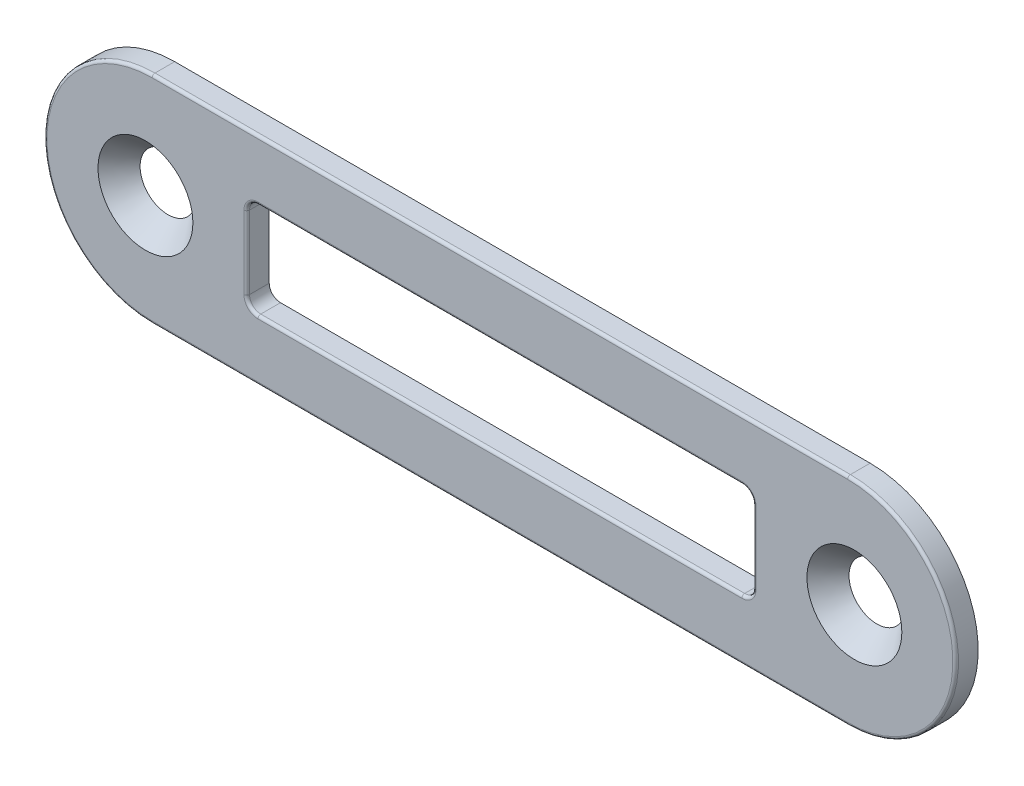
ISO-10303-21;
HEADER;
FILE_DESCRIPTION(('STEP AP214'),'2;1');
FILE_NAME('part.step','',(''),(''),'','','');
FILE_SCHEMA(('AUTOMOTIVE_DESIGN { 1 0 10303 214 1 1 1 1 }'));
ENDSEC;
DATA;
#1=APPLICATION_CONTEXT('core data for automotive mechanical design processes');
#2=APPLICATION_PROTOCOL_DEFINITION('international standard','automotive_design',2000,#1);
#3=PRODUCT_CONTEXT('',#1,'mechanical');
#4=PRODUCT('Part','Part','',(#3));
#5=PRODUCT_RELATED_PRODUCT_CATEGORY('part','',(#4));
#6=PRODUCT_DEFINITION_FORMATION('','',#4);
#7=PRODUCT_DEFINITION_CONTEXT('part definition',#1,'design');
#8=PRODUCT_DEFINITION('design','',#6,#7);
#9=PRODUCT_DEFINITION_SHAPE('','',#8);
#10=(LENGTH_UNIT() NAMED_UNIT(*) SI_UNIT(.MILLI.,.METRE.));
#11=(NAMED_UNIT(*) PLANE_ANGLE_UNIT() SI_UNIT($,.RADIAN.));
#12=(NAMED_UNIT(*) SI_UNIT($,.STERADIAN.) SOLID_ANGLE_UNIT());
#13=UNCERTAINTY_MEASURE_WITH_UNIT(LENGTH_MEASURE(1.E-05),#10,'distance_accuracy_value','');
#14=(GEOMETRIC_REPRESENTATION_CONTEXT(3) GLOBAL_UNCERTAINTY_ASSIGNED_CONTEXT((#13)) GLOBAL_UNIT_ASSIGNED_CONTEXT((#10,
#11,#12)) REPRESENTATION_CONTEXT('',''));
#15=CARTESIAN_POINT('',(0.,0.,0.));
#16=DIRECTION('',(0.,0.,1.));
#17=DIRECTION('',(1.,0.,0.));
#18=AXIS2_PLACEMENT_3D('',#15,#16,#17);
#19=CARTESIAN_POINT('',(0.,9.6,0.));
#20=DIRECTION('',(0.,0.,1.));
#21=DIRECTION('',(1.,0.,0.));
#22=AXIS2_PLACEMENT_3D('',#19,#20,#21);
#23=PLANE('',#22);
#24=CARTESIAN_POINT('',(-0.599999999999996,9.60000000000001,0.));
#25=DIRECTION('',(0.,0.,1.));
#26=DIRECTION('',(1.,0.,0.));
#27=AXIS2_PLACEMENT_3D('',#24,#25,#26);
#28=CIRCLE('',#27,2.47782652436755);
#29=CARTESIAN_POINT('',(1.87782652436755,9.60000000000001,0.));
#30=VERTEX_POINT('',#29);
#31=EDGE_CURVE('E232',#30,#30,#28,.T.);
#32=ORIENTED_EDGE('',*,*,#31,.T.);
#33=EDGE_LOOP('',(#32));
#34=FACE_BOUND('',#33,.T.);
#35=CARTESIAN_POINT('',(0.,9.6,0.));
#36=DIRECTION('',(0.,0.,1.));
#37=DIRECTION('',(1.,0.,0.));
#38=AXIS2_PLACEMENT_3D('',#35,#36,#37);
#39=CIRCLE('',#38,9.6);
#40=CARTESIAN_POINT('',(0.,19.2,0.));
#41=VERTEX_POINT('',#40);
#42=CARTESIAN_POINT('',(0.,0.,0.));
#43=VERTEX_POINT('',#42);
#44=EDGE_CURVE('E194',#41,#43,#39,.T.);
#45=ORIENTED_EDGE('',*,*,#44,.F.);
#46=DIRECTION('',(-1.,0.,0.));
#47=VECTOR('',#46,1.);
#48=CARTESIAN_POINT('',(0.,19.2,0.));
#49=LINE('',#48,#47);
#50=CARTESIAN_POINT('',(61.8,19.2,0.));
#51=VERTEX_POINT('',#50);
#52=EDGE_CURVE('E216',#51,#41,#49,.T.);
#53=ORIENTED_EDGE('',*,*,#52,.F.);
#54=CARTESIAN_POINT('',(61.8,9.60000000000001,0.));
#55=DIRECTION('',(0.,0.,1.));
#56=DIRECTION('',(-1.,0.,0.));
#57=AXIS2_PLACEMENT_3D('',#54,#55,#56);
#58=CIRCLE('',#57,9.6);
#59=CARTESIAN_POINT('',(61.8,0.,0.));
#60=VERTEX_POINT('',#59);
#61=EDGE_CURVE('E196',#60,#51,#58,.T.);
#62=ORIENTED_EDGE('',*,*,#61,.F.);
#63=DIRECTION('',(1.,0.,0.));
#64=VECTOR('',#63,1.);
#65=CARTESIAN_POINT('',(0.,0.,0.));
#66=LINE('',#65,#64);
#67=EDGE_CURVE('E179',#43,#60,#66,.T.);
#68=ORIENTED_EDGE('',*,*,#67,.F.);
#69=EDGE_LOOP('',(#45,#53,#62,#68));
#70=FACE_BOUND('',#69,.T.);
#71=DIRECTION('',(0.,-1.,0.));
#72=VECTOR('',#71,1.);
#73=CARTESIAN_POINT('',(8.4,13.85,0.));
#74=LINE('',#73,#72);
#75=CARTESIAN_POINT('',(8.4,12.85,0.));
#76=VERTEX_POINT('',#75);
#77=CARTESIAN_POINT('',(8.4,6.35000000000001,0.));
#78=VERTEX_POINT('',#77);
#79=EDGE_CURVE('E210',#76,#78,#74,.T.);
#80=ORIENTED_EDGE('',*,*,#79,.T.);
#81=CARTESIAN_POINT('',(9.4,6.35000000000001,0.));
#82=DIRECTION('',(0.,0.,1.));
#83=DIRECTION('',(1.,0.,0.));
#84=AXIS2_PLACEMENT_3D('',#81,#82,#83);
#85=CIRCLE('',#84,1.);
#86=CARTESIAN_POINT('',(9.4,5.35000000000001,0.));
#87=VERTEX_POINT('',#86);
#88=EDGE_CURVE('E269',#78,#87,#85,.T.);
#89=ORIENTED_EDGE('',*,*,#88,.T.);
#90=DIRECTION('',(1.,0.,0.));
#91=VECTOR('',#90,1.);
#92=CARTESIAN_POINT('',(8.4,5.35000000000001,0.));
#93=LINE('',#92,#91);
#94=CARTESIAN_POINT('',(52.4,5.35000000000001,0.));
#95=VERTEX_POINT('',#94);
#96=EDGE_CURVE('E203',#87,#95,#93,.T.);
#97=ORIENTED_EDGE('',*,*,#96,.T.);
#98=CARTESIAN_POINT('',(52.4,6.35000000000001,0.));
#99=DIRECTION('',(0.,0.,1.));
#100=DIRECTION('',(1.,0.,0.));
#101=AXIS2_PLACEMENT_3D('',#98,#99,#100);
#102=CIRCLE('',#101,1.);
#103=CARTESIAN_POINT('',(53.4,6.35000000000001,0.));
#104=VERTEX_POINT('',#103);
#105=EDGE_CURVE('E267',#95,#104,#102,.T.);
#106=ORIENTED_EDGE('',*,*,#105,.T.);
#107=DIRECTION('',(0.,1.,0.));
#108=VECTOR('',#107,1.);
#109=CARTESIAN_POINT('',(53.4,13.85,0.));
#110=LINE('',#109,#108);
#111=CARTESIAN_POINT('',(53.4,12.85,0.));
#112=VERTEX_POINT('',#111);
#113=EDGE_CURVE('E230',#104,#112,#110,.T.);
#114=ORIENTED_EDGE('',*,*,#113,.T.);
#115=CARTESIAN_POINT('',(52.4,12.85,0.));
#116=DIRECTION('',(0.,0.,1.));
#117=DIRECTION('',(1.,0.,0.));
#118=AXIS2_PLACEMENT_3D('',#115,#116,#117);
#119=CIRCLE('',#118,1.);
#120=CARTESIAN_POINT('',(52.4,13.85,0.));
#121=VERTEX_POINT('',#120);
#122=EDGE_CURVE('E264',#112,#121,#119,.T.);
#123=ORIENTED_EDGE('',*,*,#122,.T.);
#124=DIRECTION('',(-1.,0.,0.));
#125=VECTOR('',#124,1.);
#126=CARTESIAN_POINT('',(8.4,13.85,0.));
#127=LINE('',#126,#125);
#128=CARTESIAN_POINT('',(9.4,13.85,0.));
#129=VERTEX_POINT('',#128);
#130=EDGE_CURVE('E467',#121,#129,#127,.T.);
#131=ORIENTED_EDGE('',*,*,#130,.T.);
#132=CARTESIAN_POINT('',(9.4,12.85,0.));
#133=DIRECTION('',(0.,0.,1.));
#134=DIRECTION('',(1.,0.,0.));
#135=AXIS2_PLACEMENT_3D('',#132,#133,#134);
#136=CIRCLE('',#135,1.);
#137=EDGE_CURVE('E272',#129,#76,#136,.T.);
#138=ORIENTED_EDGE('',*,*,#137,.T.);
#139=EDGE_LOOP('',(#80,#89,#97,#106,#114,#123,#131,#138));
#140=FACE_BOUND('',#139,.T.);
#141=CARTESIAN_POINT('',(62.4,9.6,0.));
#142=DIRECTION('',(0.,0.,1.));
#143=DIRECTION('',(1.,0.,0.));
#144=AXIS2_PLACEMENT_3D('',#141,#142,#143);
#145=CIRCLE('',#144,2.47782652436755);
#146=CARTESIAN_POINT('',(64.8778265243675,9.6,0.));
#147=VERTEX_POINT('',#146);
#148=EDGE_CURVE('E226',#147,#147,#145,.T.);
#149=ORIENTED_EDGE('',*,*,#148,.T.);
#150=EDGE_LOOP('',(#149));
#151=FACE_BOUND('',#150,.T.);
#152=ADVANCED_FACE('F48',(#34,#70,#140,#151),#23,.F.);
#153=CARTESIAN_POINT('',(0.,9.6,2.));
#154=DIRECTION('',(0.,0.,-1.));
#155=DIRECTION('',(-1.,0.,0.));
#156=AXIS2_PLACEMENT_3D('',#153,#154,#155);
#157=CYLINDRICAL_SURFACE('',#156,9.6);
#158=DIRECTION('',(0.,0.,-1.));
#159=VECTOR('',#158,1.);
#160=CARTESIAN_POINT('',(0.,0.,2.));
#161=LINE('',#160,#159);
#162=CARTESIAN_POINT('',(0.,0.,1.75));
#163=VERTEX_POINT('',#162);
#164=EDGE_CURVE('E176',#163,#43,#161,.T.);
#165=ORIENTED_EDGE('',*,*,#164,.F.);
#166=CARTESIAN_POINT('',(0.,9.6,1.75));
#167=DIRECTION('',(0.,0.,1.));
#168=DIRECTION('',(1.,0.,0.));
#169=AXIS2_PLACEMENT_3D('',#166,#167,#168);
#170=CIRCLE('',#169,9.6);
#171=CARTESIAN_POINT('',(0.,19.2,1.75));
#172=VERTEX_POINT('',#171);
#173=EDGE_CURVE('E335',#163,#172,#170,.F.);
#174=ORIENTED_EDGE('',*,*,#173,.T.);
#175=DIRECTION('',(0.,0.,-1.));
#176=VECTOR('',#175,1.);
#177=CARTESIAN_POINT('',(0.,19.2,2.));
#178=LINE('',#177,#176);
#179=EDGE_CURVE('E200',#172,#41,#178,.T.);
#180=ORIENTED_EDGE('',*,*,#179,.T.);
#181=ORIENTED_EDGE('',*,*,#44,.T.);
#182=EDGE_LOOP('',(#165,#174,#180,#181));
#183=FACE_BOUND('',#182,.T.);
#184=ADVANCED_FACE('F199',(#183),#157,.T.);
#185=CARTESIAN_POINT('',(0.,0.,2.));
#186=DIRECTION('',(0.,1.,0.));
#187=DIRECTION('',(-1.,0.,0.));
#188=AXIS2_PLACEMENT_3D('',#185,#186,#187);
#189=PLANE('',#188);
#190=DIRECTION('',(0.,0.,-1.));
#191=VECTOR('',#190,1.);
#192=CARTESIAN_POINT('',(61.8,0.,2.));
#193=LINE('',#192,#191);
#194=CARTESIAN_POINT('',(61.8,0.,1.75));
#195=VERTEX_POINT('',#194);
#196=EDGE_CURVE('E188',#195,#60,#193,.T.);
#197=ORIENTED_EDGE('',*,*,#196,.F.);
#198=DIRECTION('',(1.,0.,0.));
#199=VECTOR('',#198,1.);
#200=CARTESIAN_POINT('',(0.,0.,1.75));
#201=LINE('',#200,#199);
#202=EDGE_CURVE('E11',#195,#163,#201,.F.);
#203=ORIENTED_EDGE('',*,*,#202,.T.);
#204=ORIENTED_EDGE('',*,*,#164,.T.);
#205=ORIENTED_EDGE('',*,*,#67,.T.);
#206=EDGE_LOOP('',(#197,#203,#204,#205));
#207=FACE_BOUND('',#206,.T.);
#208=ADVANCED_FACE('F178',(#207),#189,.F.);
#209=CARTESIAN_POINT('',(61.8,9.60000000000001,2.));
#210=DIRECTION('',(0.,0.,-1.));
#211=DIRECTION('',(-1.,0.,0.));
#212=AXIS2_PLACEMENT_3D('',#209,#210,#211);
#213=CYLINDRICAL_SURFACE('',#212,9.6);
#214=DIRECTION('',(0.,0.,-1.));
#215=VECTOR('',#214,1.);
#216=CARTESIAN_POINT('',(61.8,19.2,2.));
#217=LINE('',#216,#215);
#218=CARTESIAN_POINT('',(61.8,19.2,1.75));
#219=VERTEX_POINT('',#218);
#220=EDGE_CURVE('E221',#219,#51,#217,.T.);
#221=ORIENTED_EDGE('',*,*,#220,.F.);
#222=CARTESIAN_POINT('',(61.8,9.60000000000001,1.75));
#223=DIRECTION('',(0.,0.,1.));
#224=DIRECTION('',(1.,0.,0.));
#225=AXIS2_PLACEMENT_3D('',#222,#223,#224);
#226=CIRCLE('',#225,9.6);
#227=EDGE_CURVE('E66',#219,#195,#226,.F.);
#228=ORIENTED_EDGE('',*,*,#227,.T.);
#229=ORIENTED_EDGE('',*,*,#196,.T.);
#230=ORIENTED_EDGE('',*,*,#61,.T.);
#231=EDGE_LOOP('',(#221,#228,#229,#230));
#232=FACE_BOUND('',#231,.T.);
#233=ADVANCED_FACE('F401',(#232),#213,.T.);
#234=CARTESIAN_POINT('',(0.,19.2,2.));
#235=DIRECTION('',(0.,-1.,0.));
#236=DIRECTION('',(1.,0.,0.));
#237=AXIS2_PLACEMENT_3D('',#234,#235,#236);
#238=PLANE('',#237);
#239=ORIENTED_EDGE('',*,*,#179,.F.);
#240=DIRECTION('',(-1.,0.,0.));
#241=VECTOR('',#240,1.);
#242=CARTESIAN_POINT('',(61.8,19.2,1.75));
#243=LINE('',#242,#241);
#244=EDGE_CURVE('E74',#172,#219,#243,.F.);
#245=ORIENTED_EDGE('',*,*,#244,.T.);
#246=ORIENTED_EDGE('',*,*,#220,.T.);
#247=ORIENTED_EDGE('',*,*,#52,.T.);
#248=EDGE_LOOP('',(#239,#245,#246,#247));
#249=FACE_BOUND('',#248,.T.);
#250=ADVANCED_FACE('F400',(#249),#238,.F.);
#251=CARTESIAN_POINT('',(0.,9.6,2.));
#252=DIRECTION('',(0.,0.,1.));
#253=DIRECTION('',(1.,0.,0.));
#254=AXIS2_PLACEMENT_3D('',#251,#252,#253);
#255=PLANE('',#254);
#256=DIRECTION('',(-1.,0.,0.));
#257=VECTOR('',#256,1.);
#258=CARTESIAN_POINT('',(52.4,14.1,2.));
#259=LINE('',#258,#257);
#260=CARTESIAN_POINT('',(9.4,14.1,2.));
#261=VERTEX_POINT('',#260);
#262=CARTESIAN_POINT('',(52.4,14.1,2.));
#263=VERTEX_POINT('',#262);
#264=EDGE_CURVE('E288',#261,#263,#259,.F.);
#265=ORIENTED_EDGE('',*,*,#264,.T.);
#266=CARTESIAN_POINT('',(52.4,12.85,2.));
#267=DIRECTION('',(0.,0.,1.));
#268=DIRECTION('',(1.,0.,0.));
#269=AXIS2_PLACEMENT_3D('',#266,#267,#268);
#270=CIRCLE('',#269,1.25);
#271=CARTESIAN_POINT('',(53.65,12.85,2.));
#272=VERTEX_POINT('',#271);
#273=EDGE_CURVE('E309',#263,#272,#270,.F.);
#274=ORIENTED_EDGE('',*,*,#273,.T.);
#275=DIRECTION('',(0.,1.,0.));
#276=VECTOR('',#275,1.);
#277=CARTESIAN_POINT('',(53.65,6.35000000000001,2.));
#278=LINE('',#277,#276);
#279=CARTESIAN_POINT('',(53.65,6.35000000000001,2.));
#280=VERTEX_POINT('',#279);
#281=EDGE_CURVE('E306',#272,#280,#278,.F.);
#282=ORIENTED_EDGE('',*,*,#281,.T.);
#283=CARTESIAN_POINT('',(52.4,6.35000000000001,2.));
#284=DIRECTION('',(0.,0.,1.));
#285=DIRECTION('',(1.,0.,0.));
#286=AXIS2_PLACEMENT_3D('',#283,#284,#285);
#287=CIRCLE('',#286,1.25);
#288=CARTESIAN_POINT('',(52.4,5.10000000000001,2.));
#289=VERTEX_POINT('',#288);
#290=EDGE_CURVE('E303',#280,#289,#287,.F.);
#291=ORIENTED_EDGE('',*,*,#290,.T.);
#292=DIRECTION('',(1.,0.,0.));
#293=VECTOR('',#292,1.);
#294=CARTESIAN_POINT('',(9.4,5.10000000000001,2.));
#295=LINE('',#294,#293);
#296=CARTESIAN_POINT('',(9.4,5.10000000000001,2.));
#297=VERTEX_POINT('',#296);
#298=EDGE_CURVE('E300',#289,#297,#295,.F.);
#299=ORIENTED_EDGE('',*,*,#298,.T.);
#300=CARTESIAN_POINT('',(9.4,6.35000000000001,2.));
#301=DIRECTION('',(0.,0.,1.));
#302=DIRECTION('',(1.,0.,0.));
#303=AXIS2_PLACEMENT_3D('',#300,#301,#302);
#304=CIRCLE('',#303,1.25);
#305=CARTESIAN_POINT('',(8.15,6.35000000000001,2.));
#306=VERTEX_POINT('',#305);
#307=EDGE_CURVE('E297',#297,#306,#304,.F.);
#308=ORIENTED_EDGE('',*,*,#307,.T.);
#309=DIRECTION('',(0.,-1.,0.));
#310=VECTOR('',#309,1.);
#311=CARTESIAN_POINT('',(8.15,12.85,2.));
#312=LINE('',#311,#310);
#313=CARTESIAN_POINT('',(8.15,12.85,2.));
#314=VERTEX_POINT('',#313);
#315=EDGE_CURVE('E294',#306,#314,#312,.F.);
#316=ORIENTED_EDGE('',*,*,#315,.T.);
#317=CARTESIAN_POINT('',(9.4,12.85,2.));
#318=DIRECTION('',(0.,0.,1.));
#319=DIRECTION('',(1.,0.,0.));
#320=AXIS2_PLACEMENT_3D('',#317,#318,#319);
#321=CIRCLE('',#320,1.25);
#322=EDGE_CURVE('E291',#314,#261,#321,.F.);
#323=ORIENTED_EDGE('',*,*,#322,.T.);
#324=EDGE_LOOP('',(#265,#274,#282,#291,#299,#308,#316,#323));
#325=FACE_BOUND('',#324,.T.);
#326=DIRECTION('',(-1.,0.,0.));
#327=VECTOR('',#326,1.);
#328=CARTESIAN_POINT('',(0.,18.95,2.));
#329=LINE('',#328,#327);
#330=CARTESIAN_POINT('',(61.8,18.95,2.));
#331=VERTEX_POINT('',#330);
#332=CARTESIAN_POINT('',(0.,18.95,2.));
#333=VERTEX_POINT('',#332);
#334=EDGE_CURVE('E281',#331,#333,#329,.T.);
#335=ORIENTED_EDGE('',*,*,#334,.T.);
#336=CARTESIAN_POINT('',(0.,9.6,2.));
#337=DIRECTION('',(0.,0.,1.));
#338=DIRECTION('',(1.,0.,0.));
#339=AXIS2_PLACEMENT_3D('',#336,#337,#338);
#340=CIRCLE('',#339,9.35);
#341=CARTESIAN_POINT('',(0.,0.25,2.));
#342=VERTEX_POINT('',#341);
#343=EDGE_CURVE('E284',#333,#342,#340,.T.);
#344=ORIENTED_EDGE('',*,*,#343,.T.);
#345=DIRECTION('',(1.,0.,0.));
#346=VECTOR('',#345,1.);
#347=CARTESIAN_POINT('',(61.8,0.250000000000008,2.));
#348=LINE('',#347,#346);
#349=CARTESIAN_POINT('',(61.8,0.250000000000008,2.));
#350=VERTEX_POINT('',#349);
#351=EDGE_CURVE('E275',#342,#350,#348,.T.);
#352=ORIENTED_EDGE('',*,*,#351,.T.);
#353=CARTESIAN_POINT('',(61.8,9.60000000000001,2.));
#354=DIRECTION('',(0.,0.,1.));
#355=DIRECTION('',(1.,0.,0.));
#356=AXIS2_PLACEMENT_3D('',#353,#354,#355);
#357=CIRCLE('',#356,9.35);
#358=EDGE_CURVE('E278',#350,#331,#357,.T.);
#359=ORIENTED_EDGE('',*,*,#358,.T.);
#360=EDGE_LOOP('',(#335,#344,#352,#359));
#361=FACE_BOUND('',#360,.T.);
#362=CARTESIAN_POINT('',(-0.599999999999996,9.60000000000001,2.));
#363=DIRECTION('',(0.,0.,1.));
#364=DIRECTION('',(1.,0.,0.));
#365=AXIS2_PLACEMENT_3D('',#362,#363,#364);
#366=CIRCLE('',#365,4.2164);
#367=CARTESIAN_POINT('',(3.6164,9.60000000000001,2.));
#368=VERTEX_POINT('',#367);
#369=EDGE_CURVE('E236',#368,#368,#366,.T.);
#370=ORIENTED_EDGE('',*,*,#369,.F.);
#371=EDGE_LOOP('',(#370));
#372=FACE_BOUND('',#371,.T.);
#373=CARTESIAN_POINT('',(62.4,9.6,2.));
#374=DIRECTION('',(0.,0.,1.));
#375=DIRECTION('',(1.,0.,0.));
#376=AXIS2_PLACEMENT_3D('',#373,#374,#375);
#377=CIRCLE('',#376,4.2164);
#378=CARTESIAN_POINT('',(66.6164,9.6,2.));
#379=VERTEX_POINT('',#378);
#380=EDGE_CURVE('E231',#379,#379,#377,.T.);
#381=ORIENTED_EDGE('',*,*,#380,.F.);
#382=EDGE_LOOP('',(#381));
#383=FACE_BOUND('',#382,.T.);
#384=ADVANCED_FACE('F408',(#325,#361,#372,#383),#255,.T.);
#385=CARTESIAN_POINT('',(53.4,13.85,0.));
#386=DIRECTION('',(1.,0.,0.));
#387=DIRECTION('',(0.,0.,-1.));
#388=AXIS2_PLACEMENT_3D('',#385,#386,#387);
#389=PLANE('',#388);
#390=DIRECTION('',(0.,0.,1.));
#391=VECTOR('',#390,1.);
#392=CARTESIAN_POINT('',(53.4,6.35000000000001,2.));
#393=LINE('',#392,#391);
#394=CARTESIAN_POINT('',(53.4,6.35000000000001,1.75));
#395=VERTEX_POINT('',#394);
#396=EDGE_CURVE('E243',#104,#395,#393,.T.);
#397=ORIENTED_EDGE('',*,*,#396,.T.);
#398=DIRECTION('',(0.,1.,0.));
#399=VECTOR('',#398,1.);
#400=CARTESIAN_POINT('',(53.4,12.85,1.75));
#401=LINE('',#400,#399);
#402=CARTESIAN_POINT('',(53.4,12.85,1.75));
#403=VERTEX_POINT('',#402);
#404=EDGE_CURVE('E317',#395,#403,#401,.T.);
#405=ORIENTED_EDGE('',*,*,#404,.T.);
#406=DIRECTION('',(0.,0.,1.));
#407=VECTOR('',#406,1.);
#408=CARTESIAN_POINT('',(53.4,12.85,0.));
#409=LINE('',#408,#407);
#410=EDGE_CURVE('E247',#403,#112,#409,.F.);
#411=ORIENTED_EDGE('',*,*,#410,.T.);
#412=ORIENTED_EDGE('',*,*,#113,.F.);
#413=EDGE_LOOP('',(#397,#405,#411,#412));
#414=FACE_BOUND('',#413,.T.);
#415=ADVANCED_FACE('F421',(#414),#389,.F.);
#416=CARTESIAN_POINT('',(8.4,5.35000000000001,0.));
#417=DIRECTION('',(0.,-1.,0.));
#418=DIRECTION('',(0.,0.,-1.));
#419=AXIS2_PLACEMENT_3D('',#416,#417,#418);
#420=PLANE('',#419);
#421=DIRECTION('',(0.,0.,1.));
#422=VECTOR('',#421,1.);
#423=CARTESIAN_POINT('',(9.4,5.35000000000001,2.));
#424=LINE('',#423,#422);
#425=CARTESIAN_POINT('',(9.4,5.35000000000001,1.75));
#426=VERTEX_POINT('',#425);
#427=EDGE_CURVE('E250',#87,#426,#424,.T.);
#428=ORIENTED_EDGE('',*,*,#427,.T.);
#429=DIRECTION('',(1.,0.,0.));
#430=VECTOR('',#429,1.);
#431=CARTESIAN_POINT('',(52.4,5.35000000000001,1.75));
#432=LINE('',#431,#430);
#433=CARTESIAN_POINT('',(52.4,5.35000000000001,1.75));
#434=VERTEX_POINT('',#433);
#435=EDGE_CURVE('E323',#426,#434,#432,.T.);
#436=ORIENTED_EDGE('',*,*,#435,.T.);
#437=DIRECTION('',(0.,0.,1.));
#438=VECTOR('',#437,1.);
#439=CARTESIAN_POINT('',(52.4,5.35000000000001,0.));
#440=LINE('',#439,#438);
#441=EDGE_CURVE('E254',#434,#95,#440,.F.);
#442=ORIENTED_EDGE('',*,*,#441,.T.);
#443=ORIENTED_EDGE('',*,*,#96,.F.);
#444=EDGE_LOOP('',(#428,#436,#442,#443));
#445=FACE_BOUND('',#444,.T.);
#446=ADVANCED_FACE('F425',(#445),#420,.F.);
#447=CARTESIAN_POINT('',(8.4,13.85,0.));
#448=DIRECTION('',(-1.,0.,0.));
#449=DIRECTION('',(0.,-1.,0.));
#450=AXIS2_PLACEMENT_3D('',#447,#448,#449);
#451=PLANE('',#450);
#452=DIRECTION('',(0.,0.,1.));
#453=VECTOR('',#452,1.);
#454=CARTESIAN_POINT('',(8.4,12.85,2.));
#455=LINE('',#454,#453);
#456=CARTESIAN_POINT('',(8.4,12.85,1.75));
#457=VERTEX_POINT('',#456);
#458=EDGE_CURVE('E257',#76,#457,#455,.T.);
#459=ORIENTED_EDGE('',*,*,#458,.T.);
#460=DIRECTION('',(0.,-1.,0.));
#461=VECTOR('',#460,1.);
#462=CARTESIAN_POINT('',(8.4,6.35000000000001,1.75));
#463=LINE('',#462,#461);
#464=CARTESIAN_POINT('',(8.4,6.35000000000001,1.75));
#465=VERTEX_POINT('',#464);
#466=EDGE_CURVE('E329',#457,#465,#463,.T.);
#467=ORIENTED_EDGE('',*,*,#466,.T.);
#468=DIRECTION('',(0.,0.,1.));
#469=VECTOR('',#468,1.);
#470=CARTESIAN_POINT('',(8.4,6.35000000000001,0.));
#471=LINE('',#470,#469);
#472=EDGE_CURVE('E261',#465,#78,#471,.F.);
#473=ORIENTED_EDGE('',*,*,#472,.T.);
#474=ORIENTED_EDGE('',*,*,#79,.F.);
#475=EDGE_LOOP('',(#459,#467,#473,#474));
#476=FACE_BOUND('',#475,.T.);
#477=ADVANCED_FACE('F431',(#476),#451,.F.);
#478=CARTESIAN_POINT('',(8.4,13.85,0.));
#479=DIRECTION('',(0.,1.,0.));
#480=DIRECTION('',(0.,0.,1.));
#481=AXIS2_PLACEMENT_3D('',#478,#479,#480);
#482=PLANE('',#481);
#483=DIRECTION('',(0.,0.,1.));
#484=VECTOR('',#483,1.);
#485=CARTESIAN_POINT('',(52.4,13.85,2.));
#486=LINE('',#485,#484);
#487=CARTESIAN_POINT('',(52.4,13.85,1.75));
#488=VERTEX_POINT('',#487);
#489=EDGE_CURVE('E239',#121,#488,#486,.T.);
#490=ORIENTED_EDGE('',*,*,#489,.T.);
#491=DIRECTION('',(-1.,0.,0.));
#492=VECTOR('',#491,1.);
#493=CARTESIAN_POINT('',(9.4,13.85,1.75));
#494=LINE('',#493,#492);
#495=CARTESIAN_POINT('',(9.4,13.85,1.75));
#496=VERTEX_POINT('',#495);
#497=EDGE_CURVE('E58',#488,#496,#494,.T.);
#498=ORIENTED_EDGE('',*,*,#497,.T.);
#499=DIRECTION('',(0.,0.,1.));
#500=VECTOR('',#499,1.);
#501=CARTESIAN_POINT('',(9.4,13.85,0.));
#502=LINE('',#501,#500);
#503=EDGE_CURVE('E187',#496,#129,#502,.F.);
#504=ORIENTED_EDGE('',*,*,#503,.T.);
#505=ORIENTED_EDGE('',*,*,#130,.F.);
#506=EDGE_LOOP('',(#490,#498,#504,#505));
#507=FACE_BOUND('',#506,.T.);
#508=ADVANCED_FACE('F427',(#507),#482,.F.);
#509=CARTESIAN_POINT('',(62.4,9.6,2.));
#510=DIRECTION('',(0.,0.,1.));
#511=DIRECTION('',(1.,0.,0.));
#512=AXIS2_PLACEMENT_3D('',#509,#510,#511);
#513=CONICAL_SURFACE('',#512,4.2164,0.715584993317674);
#514=ORIENTED_EDGE('',*,*,#380,.T.);
#515=EDGE_LOOP('',(#514));
#516=FACE_BOUND('',#515,.T.);
#517=ORIENTED_EDGE('',*,*,#148,.F.);
#518=EDGE_LOOP('',(#517));
#519=FACE_BOUND('',#518,.T.);
#520=ADVANCED_FACE('F430',(#516,#519),#513,.F.);
#521=CARTESIAN_POINT('',(-0.599999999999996,9.60000000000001,2.));
#522=DIRECTION('',(0.,0.,1.));
#523=DIRECTION('',(1.,0.,0.));
#524=AXIS2_PLACEMENT_3D('',#521,#522,#523);
#525=CONICAL_SURFACE('',#524,4.2164,0.715584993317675);
#526=ORIENTED_EDGE('',*,*,#369,.T.);
#527=EDGE_LOOP('',(#526));
#528=FACE_BOUND('',#527,.T.);
#529=ORIENTED_EDGE('',*,*,#31,.F.);
#530=EDGE_LOOP('',(#529));
#531=FACE_BOUND('',#530,.T.);
#532=ADVANCED_FACE('F441',(#528,#531),#525,.F.);
#533=CARTESIAN_POINT('',(52.4,12.85,0.));
#534=DIRECTION('',(0.,0.,-1.));
#535=DIRECTION('',(-1.,0.,0.));
#536=AXIS2_PLACEMENT_3D('',#533,#534,#535);
#537=CYLINDRICAL_SURFACE('',#536,1.);
#538=ORIENTED_EDGE('',*,*,#410,.F.);
#539=CARTESIAN_POINT('',(52.4,12.85,1.75));
#540=DIRECTION('',(0.,0.,1.));
#541=DIRECTION('',(1.,0.,0.));
#542=AXIS2_PLACEMENT_3D('',#539,#540,#541);
#543=CIRCLE('',#542,1.);
#544=EDGE_CURVE('E313',#403,#488,#543,.T.);
#545=ORIENTED_EDGE('',*,*,#544,.T.);
#546=ORIENTED_EDGE('',*,*,#489,.F.);
#547=ORIENTED_EDGE('',*,*,#122,.F.);
#548=EDGE_LOOP('',(#538,#545,#546,#547));
#549=FACE_BOUND('',#548,.T.);
#550=ADVANCED_FACE('F444',(#549),#537,.F.);
#551=CARTESIAN_POINT('',(52.4,6.35000000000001,0.));
#552=DIRECTION('',(0.,0.,-1.));
#553=DIRECTION('',(-1.,0.,0.));
#554=AXIS2_PLACEMENT_3D('',#551,#552,#553);
#555=CYLINDRICAL_SURFACE('',#554,1.);
#556=ORIENTED_EDGE('',*,*,#441,.F.);
#557=CARTESIAN_POINT('',(52.4,6.35000000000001,1.75));
#558=DIRECTION('',(0.,0.,1.));
#559=DIRECTION('',(1.,0.,0.));
#560=AXIS2_PLACEMENT_3D('',#557,#558,#559);
#561=CIRCLE('',#560,1.);
#562=EDGE_CURVE('E320',#434,#395,#561,.T.);
#563=ORIENTED_EDGE('',*,*,#562,.T.);
#564=ORIENTED_EDGE('',*,*,#396,.F.);
#565=ORIENTED_EDGE('',*,*,#105,.F.);
#566=EDGE_LOOP('',(#556,#563,#564,#565));
#567=FACE_BOUND('',#566,.T.);
#568=ADVANCED_FACE('F449',(#567),#555,.F.);
#569=CARTESIAN_POINT('',(9.4,6.35000000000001,0.));
#570=DIRECTION('',(0.,0.,-1.));
#571=DIRECTION('',(-1.,0.,0.));
#572=AXIS2_PLACEMENT_3D('',#569,#570,#571);
#573=CYLINDRICAL_SURFACE('',#572,1.);
#574=ORIENTED_EDGE('',*,*,#472,.F.);
#575=CARTESIAN_POINT('',(9.4,6.35000000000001,1.75));
#576=DIRECTION('',(0.,0.,1.));
#577=DIRECTION('',(1.,0.,0.));
#578=AXIS2_PLACEMENT_3D('',#575,#576,#577);
#579=CIRCLE('',#578,1.);
#580=EDGE_CURVE('E326',#465,#426,#579,.T.);
#581=ORIENTED_EDGE('',*,*,#580,.T.);
#582=ORIENTED_EDGE('',*,*,#427,.F.);
#583=ORIENTED_EDGE('',*,*,#88,.F.);
#584=EDGE_LOOP('',(#574,#581,#582,#583));
#585=FACE_BOUND('',#584,.T.);
#586=ADVANCED_FACE('F482',(#585),#573,.F.);
#587=CARTESIAN_POINT('',(9.4,12.85,0.));
#588=DIRECTION('',(0.,0.,-1.));
#589=DIRECTION('',(-1.,0.,0.));
#590=AXIS2_PLACEMENT_3D('',#587,#588,#589);
#591=CYLINDRICAL_SURFACE('',#590,1.);
#592=ORIENTED_EDGE('',*,*,#503,.F.);
#593=CARTESIAN_POINT('',(9.4,12.85,1.75));
#594=DIRECTION('',(0.,0.,1.));
#595=DIRECTION('',(1.,0.,0.));
#596=AXIS2_PLACEMENT_3D('',#593,#594,#595);
#597=CIRCLE('',#596,1.);
#598=EDGE_CURVE('E332',#496,#457,#597,.T.);
#599=ORIENTED_EDGE('',*,*,#598,.T.);
#600=ORIENTED_EDGE('',*,*,#458,.F.);
#601=ORIENTED_EDGE('',*,*,#137,.F.);
#602=EDGE_LOOP('',(#592,#599,#600,#601));
#603=FACE_BOUND('',#602,.T.);
#604=ADVANCED_FACE('F513',(#603),#591,.F.);
#605=CARTESIAN_POINT('',(9.4,6.35000000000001,1.75));
#606=DIRECTION('',(0.,0.,1.));
#607=DIRECTION('',(1.,0.,0.));
#608=AXIS2_PLACEMENT_3D('',#605,#606,#607);
#609=TOROIDAL_SURFACE('',#608,1.25,0.25);
#610=CARTESIAN_POINT('',(9.4,5.10000000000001,1.75));
#611=DIRECTION('',(1.,0.,0.));
#612=DIRECTION('',(0.,0.,-1.));
#613=AXIS2_PLACEMENT_3D('',#610,#611,#612);
#614=CIRCLE('',#613,0.25);
#615=EDGE_CURVE('E366',#426,#297,#614,.T.);
#616=ORIENTED_EDGE('',*,*,#615,.F.);
#617=ORIENTED_EDGE('',*,*,#580,.F.);
#618=CARTESIAN_POINT('',(8.15,6.35000000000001,1.75));
#619=DIRECTION('',(0.,1.,0.));
#620=DIRECTION('',(0.,0.,1.));
#621=AXIS2_PLACEMENT_3D('',#618,#619,#620);
#622=CIRCLE('',#621,0.25);
#623=EDGE_CURVE('E370',#306,#465,#622,.T.);
#624=ORIENTED_EDGE('',*,*,#623,.F.);
#625=ORIENTED_EDGE('',*,*,#307,.F.);
#626=EDGE_LOOP('',(#616,#617,#624,#625));
#627=FACE_BOUND('',#626,.T.);
#628=ADVANCED_FACE('F489',(#627),#609,.T.);
#629=CARTESIAN_POINT('',(8.15,13.85,1.75));
#630=DIRECTION('',(0.,1.,0.));
#631=DIRECTION('',(-1.,0.,0.));
#632=AXIS2_PLACEMENT_3D('',#629,#630,#631);
#633=CYLINDRICAL_SURFACE('',#632,0.25);
#634=ORIENTED_EDGE('',*,*,#623,.T.);
#635=ORIENTED_EDGE('',*,*,#466,.F.);
#636=CARTESIAN_POINT('',(8.15,12.85,1.75));
#637=DIRECTION('',(0.,1.,0.));
#638=DIRECTION('',(0.,0.,1.));
#639=AXIS2_PLACEMENT_3D('',#636,#637,#638);
#640=CIRCLE('',#639,0.25);
#641=EDGE_CURVE('E362',#314,#457,#640,.T.);
#642=ORIENTED_EDGE('',*,*,#641,.F.);
#643=ORIENTED_EDGE('',*,*,#315,.F.);
#644=EDGE_LOOP('',(#634,#635,#642,#643));
#645=FACE_BOUND('',#644,.T.);
#646=ADVANCED_FACE('F518',(#645),#633,.T.);
#647=CARTESIAN_POINT('',(8.4,5.10000000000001,1.75));
#648=DIRECTION('',(-1.,0.,0.));
#649=DIRECTION('',(0.,0.,1.));
#650=AXIS2_PLACEMENT_3D('',#647,#648,#649);
#651=CYLINDRICAL_SURFACE('',#650,0.25);
#652=ORIENTED_EDGE('',*,*,#615,.T.);
#653=ORIENTED_EDGE('',*,*,#298,.F.);
#654=CARTESIAN_POINT('',(52.4,5.10000000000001,1.75));
#655=DIRECTION('',(1.,0.,0.));
#656=DIRECTION('',(0.,0.,-1.));
#657=AXIS2_PLACEMENT_3D('',#654,#655,#656);
#658=CIRCLE('',#657,0.25);
#659=EDGE_CURVE('E358',#434,#289,#658,.T.);
#660=ORIENTED_EDGE('',*,*,#659,.F.);
#661=ORIENTED_EDGE('',*,*,#435,.F.);
#662=EDGE_LOOP('',(#652,#653,#660,#661));
#663=FACE_BOUND('',#662,.T.);
#664=ADVANCED_FACE('F494',(#663),#651,.T.);
#665=CARTESIAN_POINT('',(9.4,12.85,1.75));
#666=DIRECTION('',(0.,0.,1.));
#667=DIRECTION('',(1.,0.,0.));
#668=AXIS2_PLACEMENT_3D('',#665,#666,#667);
#669=TOROIDAL_SURFACE('',#668,1.25,0.25);
#670=ORIENTED_EDGE('',*,*,#641,.T.);
#671=ORIENTED_EDGE('',*,*,#598,.F.);
#672=CARTESIAN_POINT('',(9.4,14.1,1.75));
#673=DIRECTION('',(1.,0.,0.));
#674=DIRECTION('',(0.,0.,-1.));
#675=AXIS2_PLACEMENT_3D('',#672,#673,#674);
#676=CIRCLE('',#675,0.25);
#677=EDGE_CURVE('E354',#261,#496,#676,.T.);
#678=ORIENTED_EDGE('',*,*,#677,.F.);
#679=ORIENTED_EDGE('',*,*,#322,.F.);
#680=EDGE_LOOP('',(#670,#671,#678,#679));
#681=FACE_BOUND('',#680,.T.);
#682=ADVANCED_FACE('F522',(#681),#669,.T.);
#683=CARTESIAN_POINT('',(52.4,6.35000000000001,1.75));
#684=DIRECTION('',(0.,0.,1.));
#685=DIRECTION('',(1.,0.,0.));
#686=AXIS2_PLACEMENT_3D('',#683,#684,#685);
#687=TOROIDAL_SURFACE('',#686,1.25,0.25);
#688=ORIENTED_EDGE('',*,*,#659,.T.);
#689=ORIENTED_EDGE('',*,*,#290,.F.);
#690=CARTESIAN_POINT('',(53.65,6.35000000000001,1.75));
#691=DIRECTION('',(0.,1.,0.));
#692=DIRECTION('',(0.,0.,1.));
#693=AXIS2_PLACEMENT_3D('',#690,#691,#692);
#694=CIRCLE('',#693,0.25);
#695=EDGE_CURVE('E350',#395,#280,#694,.T.);
#696=ORIENTED_EDGE('',*,*,#695,.F.);
#697=ORIENTED_EDGE('',*,*,#562,.F.);
#698=EDGE_LOOP('',(#688,#689,#696,#697));
#699=FACE_BOUND('',#698,.T.);
#700=ADVANCED_FACE('F499',(#699),#687,.T.);
#701=CARTESIAN_POINT('',(8.4,14.1,1.75));
#702=DIRECTION('',(1.,0.,0.));
#703=DIRECTION('',(0.,0.,-1.));
#704=AXIS2_PLACEMENT_3D('',#701,#702,#703);
#705=CYLINDRICAL_SURFACE('',#704,0.25);
#706=ORIENTED_EDGE('',*,*,#677,.T.);
#707=ORIENTED_EDGE('',*,*,#497,.F.);
#708=CARTESIAN_POINT('',(52.4,14.1,1.75));
#709=DIRECTION('',(1.,0.,0.));
#710=DIRECTION('',(0.,0.,-1.));
#711=AXIS2_PLACEMENT_3D('',#708,#709,#710);
#712=CIRCLE('',#711,0.25);
#713=EDGE_CURVE('E347',#263,#488,#712,.T.);
#714=ORIENTED_EDGE('',*,*,#713,.F.);
#715=ORIENTED_EDGE('',*,*,#264,.F.);
#716=EDGE_LOOP('',(#706,#707,#714,#715));
#717=FACE_BOUND('',#716,.T.);
#718=ADVANCED_FACE('F535',(#717),#705,.T.);
#719=CARTESIAN_POINT('',(53.65,13.85,1.75));
#720=DIRECTION('',(0.,-1.,0.));
#721=DIRECTION('',(0.,0.,-1.));
#722=AXIS2_PLACEMENT_3D('',#719,#720,#721);
#723=CYLINDRICAL_SURFACE('',#722,0.25);
#724=ORIENTED_EDGE('',*,*,#695,.T.);
#725=ORIENTED_EDGE('',*,*,#281,.F.);
#726=CARTESIAN_POINT('',(53.65,12.85,1.75));
#727=DIRECTION('',(0.,1.,0.));
#728=DIRECTION('',(0.,0.,1.));
#729=AXIS2_PLACEMENT_3D('',#726,#727,#728);
#730=CIRCLE('',#729,0.25);
#731=EDGE_CURVE('E344',#403,#272,#730,.T.);
#732=ORIENTED_EDGE('',*,*,#731,.F.);
#733=ORIENTED_EDGE('',*,*,#404,.F.);
#734=EDGE_LOOP('',(#724,#725,#732,#733));
#735=FACE_BOUND('',#734,.T.);
#736=ADVANCED_FACE('F529',(#735),#723,.T.);
#737=CARTESIAN_POINT('',(52.4,12.85,1.75));
#738=DIRECTION('',(0.,0.,1.));
#739=DIRECTION('',(1.,0.,0.));
#740=AXIS2_PLACEMENT_3D('',#737,#738,#739);
#741=TOROIDAL_SURFACE('',#740,1.25,0.25);
#742=ORIENTED_EDGE('',*,*,#713,.T.);
#743=ORIENTED_EDGE('',*,*,#544,.F.);
#744=ORIENTED_EDGE('',*,*,#731,.T.);
#745=ORIENTED_EDGE('',*,*,#273,.F.);
#746=EDGE_LOOP('',(#742,#743,#744,#745));
#747=FACE_BOUND('',#746,.T.);
#748=ADVANCED_FACE('F533',(#747),#741,.T.);
#749=CARTESIAN_POINT('',(61.8,9.60000000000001,1.75));
#750=DIRECTION('',(0.,0.,1.));
#751=DIRECTION('',(1.,0.,0.));
#752=AXIS2_PLACEMENT_3D('',#749,#750,#751);
#753=TOROIDAL_SURFACE('',#752,9.35,0.25);
#754=CARTESIAN_POINT('',(61.8,0.250000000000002,1.75));
#755=DIRECTION('',(-1.,0.,0.));
#756=DIRECTION('',(0.,0.,1.));
#757=AXIS2_PLACEMENT_3D('',#754,#755,#756);
#758=CIRCLE('',#757,0.25);
#759=EDGE_CURVE('E378',#195,#350,#758,.T.);
#760=ORIENTED_EDGE('',*,*,#759,.F.);
#761=ORIENTED_EDGE('',*,*,#227,.F.);
#762=CARTESIAN_POINT('',(61.8,18.95,1.75));
#763=DIRECTION('',(-1.,0.,0.));
#764=DIRECTION('',(0.,0.,1.));
#765=AXIS2_PLACEMENT_3D('',#762,#763,#764);
#766=CIRCLE('',#765,0.25);
#767=EDGE_CURVE('E52',#331,#219,#766,.T.);
#768=ORIENTED_EDGE('',*,*,#767,.F.);
#769=ORIENTED_EDGE('',*,*,#358,.F.);
#770=EDGE_LOOP('',(#760,#761,#768,#769));
#771=FACE_BOUND('',#770,.T.);
#772=ADVANCED_FACE('F50',(#771),#753,.T.);
#773=CARTESIAN_POINT('',(0.,18.95,1.75));
#774=DIRECTION('',(1.,0.,0.));
#775=DIRECTION('',(0.,1.,0.));
#776=AXIS2_PLACEMENT_3D('',#773,#774,#775);
#777=CYLINDRICAL_SURFACE('',#776,0.25);
#778=ORIENTED_EDGE('',*,*,#767,.T.);
#779=ORIENTED_EDGE('',*,*,#244,.F.);
#780=CARTESIAN_POINT('',(0.,18.95,1.75));
#781=DIRECTION('',(-1.,0.,0.));
#782=DIRECTION('',(0.,-1.,0.));
#783=AXIS2_PLACEMENT_3D('',#780,#781,#782);
#784=CIRCLE('',#783,0.25);
#785=EDGE_CURVE('E376',#333,#172,#784,.T.);
#786=ORIENTED_EDGE('',*,*,#785,.F.);
#787=ORIENTED_EDGE('',*,*,#334,.F.);
#788=EDGE_LOOP('',(#778,#779,#786,#787));
#789=FACE_BOUND('',#788,.T.);
#790=ADVANCED_FACE('F391',(#789),#777,.T.);
#791=CARTESIAN_POINT('',(0.,0.25,1.75));
#792=DIRECTION('',(-1.,0.,0.));
#793=DIRECTION('',(0.,-1.,0.));
#794=AXIS2_PLACEMENT_3D('',#791,#792,#793);
#795=CYLINDRICAL_SURFACE('',#794,0.25);
#796=ORIENTED_EDGE('',*,*,#759,.T.);
#797=ORIENTED_EDGE('',*,*,#351,.F.);
#798=CARTESIAN_POINT('',(0.,0.25,1.75));
#799=DIRECTION('',(-1.,0.,0.));
#800=DIRECTION('',(0.,0.,1.));
#801=AXIS2_PLACEMENT_3D('',#798,#799,#800);
#802=CIRCLE('',#801,0.25);
#803=EDGE_CURVE('E374',#163,#342,#802,.T.);
#804=ORIENTED_EDGE('',*,*,#803,.F.);
#805=ORIENTED_EDGE('',*,*,#202,.F.);
#806=EDGE_LOOP('',(#796,#797,#804,#805));
#807=FACE_BOUND('',#806,.T.);
#808=ADVANCED_FACE('F396',(#807),#795,.T.);
#809=CARTESIAN_POINT('',(0.,9.6,1.75));
#810=DIRECTION('',(0.,0.,1.));
#811=DIRECTION('',(1.,0.,0.));
#812=AXIS2_PLACEMENT_3D('',#809,#810,#811);
#813=TOROIDAL_SURFACE('',#812,9.35,0.25);
#814=ORIENTED_EDGE('',*,*,#785,.T.);
#815=ORIENTED_EDGE('',*,*,#173,.F.);
#816=ORIENTED_EDGE('',*,*,#803,.T.);
#817=ORIENTED_EDGE('',*,*,#343,.F.);
#818=EDGE_LOOP('',(#814,#815,#816,#817));
#819=FACE_BOUND('',#818,.T.);
#820=ADVANCED_FACE('F399',(#819),#813,.T.);
#821=CLOSED_SHELL('',(#152,#184,#208,#233,#250,#384,#415,#446,#477,#508,#520,#532,#550,#568,
#586,#604,#628,#646,#664,#682,#700,#718,#736,#748,#772,#790,#808,#820));
#822=MANIFOLD_SOLID_BREP('B2',#821);
#823=ADVANCED_BREP_SHAPE_REPRESENTATION('',(#18,#822),#14);
#824=SHAPE_DEFINITION_REPRESENTATION(#9,#823);
ENDSEC;
END-ISO-10303-21;
